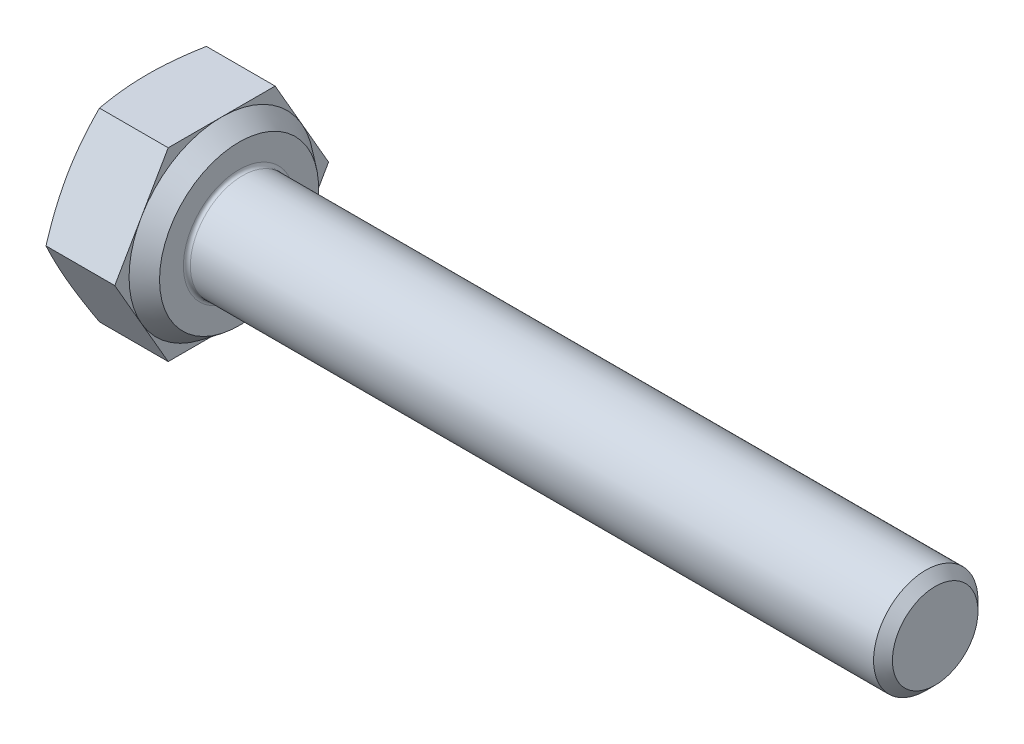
ISO-10303-21;
HEADER;
FILE_DESCRIPTION(('STEP AP214'),'2;1');
FILE_NAME('part.step','',(''),(''),'','','');
FILE_SCHEMA(('AUTOMOTIVE_DESIGN { 1 0 10303 214 1 1 1 1 }'));
ENDSEC;
DATA;
#1=APPLICATION_CONTEXT('core data for automotive mechanical design processes');
#2=APPLICATION_PROTOCOL_DEFINITION('international standard','automotive_design',2000,#1);
#3=PRODUCT_CONTEXT('',#1,'mechanical');
#4=PRODUCT('Part','Part','',(#3));
#5=PRODUCT_RELATED_PRODUCT_CATEGORY('part','',(#4));
#6=PRODUCT_DEFINITION_FORMATION('','',#4);
#7=PRODUCT_DEFINITION_CONTEXT('part definition',#1,'design');
#8=PRODUCT_DEFINITION('design','',#6,#7);
#9=PRODUCT_DEFINITION_SHAPE('','',#8);
#10=(LENGTH_UNIT() NAMED_UNIT(*) SI_UNIT(.MILLI.,.METRE.));
#11=(NAMED_UNIT(*) PLANE_ANGLE_UNIT() SI_UNIT($,.RADIAN.));
#12=(NAMED_UNIT(*) SI_UNIT($,.STERADIAN.) SOLID_ANGLE_UNIT());
#13=UNCERTAINTY_MEASURE_WITH_UNIT(LENGTH_MEASURE(1.E-05),#10,'distance_accuracy_value','');
#14=(GEOMETRIC_REPRESENTATION_CONTEXT(3) GLOBAL_UNCERTAINTY_ASSIGNED_CONTEXT((#13)) GLOBAL_UNIT_ASSIGNED_CONTEXT((#10,
#11,#12)) REPRESENTATION_CONTEXT('',''));
#15=CARTESIAN_POINT('',(0.,0.,0.));
#16=DIRECTION('',(0.,0.,1.));
#17=DIRECTION('',(1.,0.,0.));
#18=AXIS2_PLACEMENT_3D('',#15,#16,#17);
#19=CARTESIAN_POINT('',(2.625,0.,0.));
#20=DIRECTION('',(1.,0.,0.));
#21=DIRECTION('',(0.,0.,-1.));
#22=AXIS2_PLACEMENT_3D('',#19,#20,#21);
#23=PLANE('',#22);
#24=CARTESIAN_POINT('',(2.625,0.,0.));
#25=DIRECTION('',(1.,0.,0.));
#26=DIRECTION('',(0.,0.,-1.));
#27=AXIS2_PLACEMENT_3D('',#24,#25,#26);
#28=CIRCLE('',#27,1.6);
#29=CARTESIAN_POINT('',(2.625,0.,-1.6));
#30=VERTEX_POINT('',#29);
#31=EDGE_CURVE('E188',#30,#30,#28,.F.);
#32=ORIENTED_EDGE('',*,*,#31,.T.);
#33=EDGE_LOOP('',(#32));
#34=FACE_BOUND('',#33,.T.);
#35=CARTESIAN_POINT('',(2.625,0.,0.));
#36=DIRECTION('',(-1.,0.,0.));
#37=DIRECTION('',(0.,0.,1.));
#38=AXIS2_PLACEMENT_3D('',#35,#36,#37);
#39=CIRCLE('',#38,2.285);
#40=CARTESIAN_POINT('',(2.625,0.,2.285));
#41=VERTEX_POINT('',#40);
#42=EDGE_CURVE('E139',#41,#41,#39,.T.);
#43=ORIENTED_EDGE('',*,*,#42,.F.);
#44=EDGE_LOOP('',(#43));
#45=FACE_BOUND('',#44,.T.);
#46=ADVANCED_FACE('F33',(#34,#45),#23,.T.);
#47=CARTESIAN_POINT('',(2.125,0.,-3.07150343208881));
#48=DIRECTION('',(1.,0.,0.));
#49=DIRECTION('',(0.,0.,-1.));
#50=AXIS2_PLACEMENT_3D('',#47,#48,#49);
#51=PLANE('',#50);
#52=DIRECTION('',(0.,-0.866025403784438,0.5));
#53=VECTOR('',#52,1.);
#54=CARTESIAN_POINT('',(2.125,2.66,1.53575171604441));
#55=LINE('',#54,#53);
#56=CARTESIAN_POINT('',(2.125,2.66,1.53575171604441));
#57=VERTEX_POINT('',#56);
#58=CARTESIAN_POINT('',(2.125,1.33,2.30362757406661));
#59=VERTEX_POINT('',#58);
#60=EDGE_CURVE('E138',#57,#59,#55,.T.);
#61=ORIENTED_EDGE('',*,*,#60,.T.);
#62=CARTESIAN_POINT('',(2.125,0.,0.));
#63=DIRECTION('',(-1.,0.,0.));
#64=DIRECTION('',(0.,0.,1.));
#65=AXIS2_PLACEMENT_3D('',#62,#63,#64);
#66=CIRCLE('',#65,2.66);
#67=CARTESIAN_POINT('',(2.125,2.66,0.));
#68=VERTEX_POINT('',#67);
#69=EDGE_CURVE('E49',#59,#68,#66,.T.);
#70=ORIENTED_EDGE('',*,*,#69,.T.);
#71=DIRECTION('',(0.,0.,1.));
#72=VECTOR('',#71,1.);
#73=CARTESIAN_POINT('',(2.125,2.66,-1.5357517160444));
#74=LINE('',#73,#72);
#75=EDGE_CURVE('E135',#68,#57,#74,.T.);
#76=ORIENTED_EDGE('',*,*,#75,.T.);
#77=EDGE_LOOP('',(#61,#70,#76));
#78=FACE_BOUND('',#77,.T.);
#79=ADVANCED_FACE('F134',(#78),#51,.T.);
#80=CARTESIAN_POINT('',(2.125,2.66,-1.5357517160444));
#81=VERTEX_POINT('',#80);
#82=EDGE_CURVE('E145',#81,#68,#74,.T.);
#83=ORIENTED_EDGE('',*,*,#82,.T.);
#84=CARTESIAN_POINT('',(2.125,1.33,-2.3036275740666));
#85=VERTEX_POINT('',#84);
#86=EDGE_CURVE('E122',#68,#85,#66,.T.);
#87=ORIENTED_EDGE('',*,*,#86,.T.);
#88=DIRECTION('',(0.,0.866025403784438,0.5));
#89=VECTOR('',#88,1.);
#90=CARTESIAN_POINT('',(2.125,0.,-3.07150343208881));
#91=LINE('',#90,#89);
#92=EDGE_CURVE('E151',#85,#81,#91,.T.);
#93=ORIENTED_EDGE('',*,*,#92,.T.);
#94=EDGE_LOOP('',(#83,#87,#93));
#95=FACE_BOUND('',#94,.T.);
#96=ADVANCED_FACE('F150',(#95),#51,.T.);
#97=CARTESIAN_POINT('',(2.125,0.,-3.07150343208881));
#98=VERTEX_POINT('',#97);
#99=EDGE_CURVE('E148',#98,#85,#91,.T.);
#100=ORIENTED_EDGE('',*,*,#99,.T.);
#101=CARTESIAN_POINT('',(2.125,-1.33,-2.3036275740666));
#102=VERTEX_POINT('',#101);
#103=EDGE_CURVE('E125',#85,#102,#66,.T.);
#104=ORIENTED_EDGE('',*,*,#103,.T.);
#105=DIRECTION('',(0.,0.866025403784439,-0.5));
#106=VECTOR('',#105,1.);
#107=CARTESIAN_POINT('',(2.125,-2.66,-1.53575171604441));
#108=LINE('',#107,#106);
#109=EDGE_CURVE('E306',#102,#98,#108,.T.);
#110=ORIENTED_EDGE('',*,*,#109,.T.);
#111=EDGE_LOOP('',(#100,#104,#110));
#112=FACE_BOUND('',#111,.T.);
#113=ADVANCED_FACE('F337',(#112),#51,.T.);
#114=CARTESIAN_POINT('',(2.125,-2.66,-1.53575171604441));
#115=VERTEX_POINT('',#114);
#116=EDGE_CURVE('E304',#115,#102,#108,.T.);
#117=ORIENTED_EDGE('',*,*,#116,.T.);
#118=CARTESIAN_POINT('',(2.125,-2.66,0.));
#119=VERTEX_POINT('',#118);
#120=EDGE_CURVE('E338',#102,#119,#66,.T.);
#121=ORIENTED_EDGE('',*,*,#120,.T.);
#122=DIRECTION('',(0.,0.,-1.));
#123=VECTOR('',#122,1.);
#124=CARTESIAN_POINT('',(2.125,-2.66,1.53575171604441));
#125=LINE('',#124,#123);
#126=EDGE_CURVE('E162',#119,#115,#125,.T.);
#127=ORIENTED_EDGE('',*,*,#126,.T.);
#128=EDGE_LOOP('',(#117,#121,#127));
#129=FACE_BOUND('',#128,.T.);
#130=ADVANCED_FACE('F352',(#129),#51,.T.);
#131=CARTESIAN_POINT('',(2.125,-2.66,1.53575171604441));
#132=VERTEX_POINT('',#131);
#133=EDGE_CURVE('E163',#132,#119,#125,.T.);
#134=ORIENTED_EDGE('',*,*,#133,.T.);
#135=CARTESIAN_POINT('',(2.125,-1.33,2.30362757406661));
#136=VERTEX_POINT('',#135);
#137=EDGE_CURVE('E339',#119,#136,#66,.T.);
#138=ORIENTED_EDGE('',*,*,#137,.T.);
#139=DIRECTION('',(0.,-0.866025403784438,-0.5));
#140=VECTOR('',#139,1.);
#141=CARTESIAN_POINT('',(2.125,0.,3.07150343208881));
#142=LINE('',#141,#140);
#143=EDGE_CURVE('E158',#136,#132,#142,.T.);
#144=ORIENTED_EDGE('',*,*,#143,.T.);
#145=EDGE_LOOP('',(#134,#138,#144));
#146=FACE_BOUND('',#145,.T.);
#147=ADVANCED_FACE('F347',(#146),#51,.T.);
#148=CARTESIAN_POINT('',(2.125,0.,3.07150343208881));
#149=VERTEX_POINT('',#148);
#150=EDGE_CURVE('E159',#149,#136,#142,.T.);
#151=ORIENTED_EDGE('',*,*,#150,.T.);
#152=EDGE_CURVE('E140',#136,#59,#66,.T.);
#153=ORIENTED_EDGE('',*,*,#152,.T.);
#154=EDGE_CURVE('E153',#59,#149,#55,.T.);
#155=ORIENTED_EDGE('',*,*,#154,.T.);
#156=EDGE_LOOP('',(#151,#153,#155));
#157=FACE_BOUND('',#156,.T.);
#158=ADVANCED_FACE('F213',(#157),#51,.T.);
#159=CARTESIAN_POINT('',(2.125,-2.66,-1.53575171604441));
#160=DIRECTION('',(0.,0.5,0.866025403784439));
#161=DIRECTION('',(0.,-0.866025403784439,0.5));
#162=AXIS2_PLACEMENT_3D('',#159,#160,#161);
#163=PLANE('',#162);
#164=CARTESIAN_POINT('',(0.149817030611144,0.000199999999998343,-3.07161890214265));
#165=CARTESIAN_POINT('',(0.1266552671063,-0.109972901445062,-3.00801054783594));
#166=CARTESIAN_POINT('',(0.10558551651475,-0.220509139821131,-2.94419242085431));
#167=CARTESIAN_POINT('',(0.0685164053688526,-0.44230043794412,-2.81614115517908));
#168=CARTESIAN_POINT('',(0.0525210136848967,-0.553555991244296,-2.75190773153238));
#169=CARTESIAN_POINT('',(0.0266488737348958,-0.775551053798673,-2.62373882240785));
#170=CARTESIAN_POINT('',(0.016715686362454,-0.886285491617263,-2.55980626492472));
#171=CARTESIAN_POINT('',(0.00339247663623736,-1.10801336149,-2.43179161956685));
#172=CARTESIAN_POINT('',(0.,-1.219006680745,-2.36770959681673));
#173=CARTESIAN_POINT('',(0.,-1.440993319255,-2.23954555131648));
#174=CARTESIAN_POINT('',(0.0033924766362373,-1.55198663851,-2.17546352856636));
#175=CARTESIAN_POINT('',(0.0167156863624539,-1.77371450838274,-2.04744888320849));
#176=CARTESIAN_POINT('',(0.0266488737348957,-1.88444894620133,-1.98351632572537));
#177=CARTESIAN_POINT('',(0.0525210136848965,-2.1064440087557,-1.85534741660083));
#178=CARTESIAN_POINT('',(0.0685164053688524,-2.21769956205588,-1.79111399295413));
#179=CARTESIAN_POINT('',(0.10558551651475,-2.43949086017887,-1.66306272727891));
#180=CARTESIAN_POINT('',(0.1266552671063,-2.55002709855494,-1.59924460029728));
#181=CARTESIAN_POINT('',(0.149817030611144,-2.6602,-1.53563624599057));
#182=B_SPLINE_CURVE_WITH_KNOTS('',3,(#164,#165,#166,#167,#168,#169,#170,#171,#172,#173,#174,
#175,#176,#177,#178,#179,#180,#181),.UNSPECIFIED.,.F.,.F.,(4,2,2,2,2,2,2,2,4),(0.,
0.387964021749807,0.77623074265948,1.16082524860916,1.54527541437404,1.92972558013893,
2.31432008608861,2.70258680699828,3.09055082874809),.UNSPECIFIED.);
#183=CARTESIAN_POINT('',(0.149775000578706,0.,-3.07150343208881));
#184=VERTEX_POINT('',#183);
#185=CARTESIAN_POINT('',(0.,-1.33,-2.30362757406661));
#186=VERTEX_POINT('',#185);
#187=EDGE_CURVE('E321',#184,#186,#182,.T.);
#188=ORIENTED_EDGE('',*,*,#187,.F.);
#189=DIRECTION('',(-1.,0.,0.));
#190=VECTOR('',#189,1.);
#191=CARTESIAN_POINT('',(2.125,0.,-3.07150343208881));
#192=LINE('',#191,#190);
#193=EDGE_CURVE('E178',#98,#184,#192,.T.);
#194=ORIENTED_EDGE('',*,*,#193,.F.);
#195=ORIENTED_EDGE('',*,*,#109,.F.);
#196=ORIENTED_EDGE('',*,*,#116,.F.);
#197=DIRECTION('',(-1.,0.,0.));
#198=VECTOR('',#197,1.);
#199=CARTESIAN_POINT('',(2.125,-2.66,-1.53575171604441));
#200=LINE('',#199,#198);
#201=CARTESIAN_POINT('',(0.149775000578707,-2.66,-1.53575171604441));
#202=VERTEX_POINT('',#201);
#203=EDGE_CURVE('E166',#115,#202,#200,.T.);
#204=ORIENTED_EDGE('',*,*,#203,.T.);
#205=EDGE_CURVE('E246',#186,#202,#182,.T.);
#206=ORIENTED_EDGE('',*,*,#205,.F.);
#207=EDGE_LOOP('',(#188,#194,#195,#196,#204,#206));
#208=FACE_BOUND('',#207,.T.);
#209=ADVANCED_FACE('F35',(#208),#163,.F.);
#210=CARTESIAN_POINT('',(2.125,0.,-3.07150343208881));
#211=DIRECTION('',(0.,-0.500000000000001,0.866025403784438));
#212=DIRECTION('',(0.,-0.866025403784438,-0.500000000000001));
#213=AXIS2_PLACEMENT_3D('',#210,#211,#212);
#214=PLANE('',#213);
#215=CARTESIAN_POINT('',(0.149817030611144,2.6602,-1.53563624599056));
#216=CARTESIAN_POINT('',(0.1266552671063,2.55002709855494,-1.59924460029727));
#217=CARTESIAN_POINT('',(0.10558551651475,2.43949086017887,-1.6630627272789));
#218=CARTESIAN_POINT('',(0.0685164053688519,2.21769956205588,-1.79111399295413));
#219=CARTESIAN_POINT('',(0.052521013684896,2.10644400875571,-1.85534741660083));
#220=CARTESIAN_POINT('',(0.0266488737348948,1.88444894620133,-1.98351632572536));
#221=CARTESIAN_POINT('',(0.0167156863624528,1.77371450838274,-2.04744888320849));
#222=CARTESIAN_POINT('',(0.00339247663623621,1.55198663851,-2.17546352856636));
#223=CARTESIAN_POINT('',(0.,1.440993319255,-2.23954555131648));
#224=CARTESIAN_POINT('',(0.,1.219006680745,-2.36770959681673));
#225=CARTESIAN_POINT('',(0.00339247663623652,1.10801336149,-2.43179161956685));
#226=CARTESIAN_POINT('',(0.0167156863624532,0.886285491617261,-2.55980626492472));
#227=CARTESIAN_POINT('',(0.0266488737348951,0.775551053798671,-2.62373882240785));
#228=CARTESIAN_POINT('',(0.0525210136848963,0.553555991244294,-2.75190773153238));
#229=CARTESIAN_POINT('',(0.0685164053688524,0.442300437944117,-2.81614115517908));
#230=CARTESIAN_POINT('',(0.10558551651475,0.220509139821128,-2.94419242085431));
#231=CARTESIAN_POINT('',(0.1266552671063,0.109972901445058,-3.00801054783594));
#232=CARTESIAN_POINT('',(0.149817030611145,-0.000200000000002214,-3.07161890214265));
#233=B_SPLINE_CURVE_WITH_KNOTS('',3,(#215,#216,#217,#218,#219,#220,#221,#222,#223,#224,#225,
#226,#227,#228,#229,#230,#231,#232),.UNSPECIFIED.,.F.,.F.,(4,2,2,2,2,2,2,2,4),(0.,
0.387964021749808,0.776230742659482,1.16082524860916,1.54527541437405,1.92972558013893,
2.31432008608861,2.70258680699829,3.09055082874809),.UNSPECIFIED.);
#234=CARTESIAN_POINT('',(0.149775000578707,2.66,-1.5357517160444));
#235=VERTEX_POINT('',#234);
#236=CARTESIAN_POINT('',(0.,1.33,-2.30362757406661));
#237=VERTEX_POINT('',#236);
#238=EDGE_CURVE('E261',#235,#237,#233,.T.);
#239=ORIENTED_EDGE('',*,*,#238,.F.);
#240=DIRECTION('',(-1.,0.,0.));
#241=VECTOR('',#240,1.);
#242=CARTESIAN_POINT('',(2.125,2.66,-1.5357517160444));
#243=LINE('',#242,#241);
#244=EDGE_CURVE('E176',#81,#235,#243,.T.);
#245=ORIENTED_EDGE('',*,*,#244,.F.);
#246=ORIENTED_EDGE('',*,*,#92,.F.);
#247=ORIENTED_EDGE('',*,*,#99,.F.);
#248=ORIENTED_EDGE('',*,*,#193,.T.);
#249=EDGE_CURVE('E257',#237,#184,#233,.T.);
#250=ORIENTED_EDGE('',*,*,#249,.F.);
#251=EDGE_LOOP('',(#239,#245,#246,#247,#248,#250));
#252=FACE_BOUND('',#251,.T.);
#253=ADVANCED_FACE('F267',(#252),#214,.F.);
#254=CARTESIAN_POINT('',(2.125,2.66,-1.5357517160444));
#255=DIRECTION('',(0.,-1.,0.));
#256=DIRECTION('',(0.,0.,-1.));
#257=AXIS2_PLACEMENT_3D('',#254,#255,#256);
#258=PLANE('',#257);
#259=CARTESIAN_POINT('',(0.800338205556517,2.66,-4.06613053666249));
#260=CARTESIAN_POINT('',(0.763692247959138,2.66,-3.94578245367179));
#261=CARTESIAN_POINT('',(0.727473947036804,2.66,-3.8253018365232));
#262=CARTESIAN_POINT('',(0.656129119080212,2.66,-3.58400782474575));
#263=CARTESIAN_POINT('',(0.621002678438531,2.66,-3.46319440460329));
#264=CARTESIAN_POINT('',(0.552019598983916,2.66,-3.22096029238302));
#265=CARTESIAN_POINT('',(0.518165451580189,2.66,-3.09953888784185));
#266=CARTESIAN_POINT('',(0.452123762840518,2.66,-2.8562451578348));
#267=CARTESIAN_POINT('',(0.419936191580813,2.66,-2.7343728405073));
#268=CARTESIAN_POINT('',(0.358023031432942,2.66,-2.49160023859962));
#269=CARTESIAN_POINT('',(0.32827195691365,2.66,-2.37070652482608));
#270=CARTESIAN_POINT('',(0.271306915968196,2.66,-2.1283243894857));
#271=CARTESIAN_POINT('',(0.24409306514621,2.66,-2.00683594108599));
#272=CARTESIAN_POINT('',(0.167186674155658,2.66,-1.64142901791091));
#273=CARTESIAN_POINT('',(0.122197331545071,2.66,-1.39644838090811));
#274=CARTESIAN_POINT('',(0.0708271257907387,2.66,-1.04074258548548));
#275=CARTESIAN_POINT('',(0.0568876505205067,2.66,-0.931102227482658));
#276=CARTESIAN_POINT('',(0.0332945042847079,2.66,-0.711365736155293));
#277=CARTESIAN_POINT('',(0.023640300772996,2.66,-0.601269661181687));
#278=CARTESIAN_POINT('',(0.00907749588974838,2.66,-0.380832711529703));
#279=CARTESIAN_POINT('',(0.00416576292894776,2.66,-0.270492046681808));
#280=CARTESIAN_POINT('',(-0.00066185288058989,2.66,-0.0497001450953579));
#281=CARTESIAN_POINT('',(-0.000577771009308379,2.66,0.060751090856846));
#282=CARTESIAN_POINT('',(0.00459443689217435,2.66,0.282092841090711));
#283=CARTESIAN_POINT('',(0.00970784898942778,2.66,0.392982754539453));
#284=CARTESIAN_POINT('',(0.0247038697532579,2.66,0.614440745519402));
#285=CARTESIAN_POINT('',(0.0345867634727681,2.66,0.725008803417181));
#286=CARTESIAN_POINT('',(0.0586582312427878,2.66,0.945763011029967));
#287=CARTESIAN_POINT('',(0.072850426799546,2.66,1.05594876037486));
#288=CARTESIAN_POINT('',(0.104968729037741,2.66,1.27576754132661));
#289=CARTESIAN_POINT('',(0.122894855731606,2.66,1.38540056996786));
#290=CARTESIAN_POINT('',(0.183438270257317,2.66,1.7250182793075));
#291=CARTESIAN_POINT('',(0.231440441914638,2.66,1.95404028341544));
#292=CARTESIAN_POINT('',(0.336683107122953,2.66,2.40995741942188));
#293=CARTESIAN_POINT('',(0.393926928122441,2.66,2.63685175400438));
#294=CARTESIAN_POINT('',(0.514573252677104,2.66,3.08929571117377));
#295=CARTESIAN_POINT('',(0.577983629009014,2.66,3.31484321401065));
#296=CARTESIAN_POINT('',(0.708883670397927,2.66,3.76470051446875));
#297=CARTESIAN_POINT('',(0.776372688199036,2.66,3.98901050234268));
#298=CARTESIAN_POINT('',(0.913412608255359,2.66,4.43428675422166));
#299=CARTESIAN_POINT('',(0.982932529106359,2.66,4.65526259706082));
#300=CARTESIAN_POINT('',(1.12394706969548,2.66,5.09659289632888));
#301=CARTESIAN_POINT('',(1.19544178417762,2.66,5.31694732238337));
#302=CARTESIAN_POINT('',(1.33959659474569,2.66,5.75634755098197));
#303=CARTESIAN_POINT('',(1.41225123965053,2.66,5.97539514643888));
#304=CARTESIAN_POINT('',(1.55864986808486,2.66,6.41310625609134));
#305=CARTESIAN_POINT('',(1.63239376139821,2.66,6.63176980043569));
#306=CARTESIAN_POINT('',(1.70651873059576,2.66,6.85030222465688));
#307=B_SPLINE_CURVE_WITH_KNOTS('',3,(#259,#260,#261,#262,#263,#264,#265,#266,#267,#268,#269,
#270,#271,#272,#273,#274,#275,#276,#277,#278,#279,#280,#281,#282,#283,#284,#285,#286,#287,#288,
#289,#290,#291,#292,#293,#294,#295,#296,#297,#298,#299,#300,#301,#302,#303,#304,#305,#306),
.UNSPECIFIED.,.F.,.F.,(4,2,2,2,2,2,2,2,2,2,2,2,2,2,2,2,2,2,2,2,2,2,2,4),(0.,0.377413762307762,
0.754857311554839,1.13300507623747,1.51114604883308,1.88461936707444,2.25810969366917,
3.004716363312,3.3362177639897,3.66767795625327,3.99891912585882,4.3301579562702,4.663070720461,
4.99600338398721,5.32921661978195,5.66243164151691,6.36408571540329,7.06599298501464,
7.7688084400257,8.47151265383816,9.16646049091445,9.86144172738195,10.5537859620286,
11.2460731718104),.UNSPECIFIED.);
#308=CARTESIAN_POINT('',(0.149775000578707,2.66,1.53575171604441));
#309=VERTEX_POINT('',#308);
#310=CARTESIAN_POINT('',(0.,2.66,0.));
#311=VERTEX_POINT('',#310);
#312=EDGE_CURVE('E57',#309,#311,#307,.F.);
#313=ORIENTED_EDGE('',*,*,#312,.F.);
#314=DIRECTION('',(-1.,0.,0.));
#315=VECTOR('',#314,1.);
#316=CARTESIAN_POINT('',(2.125,2.66,1.53575171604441));
#317=LINE('',#316,#315);
#318=EDGE_CURVE('E147',#57,#309,#317,.T.);
#319=ORIENTED_EDGE('',*,*,#318,.F.);
#320=ORIENTED_EDGE('',*,*,#75,.F.);
#321=ORIENTED_EDGE('',*,*,#82,.F.);
#322=ORIENTED_EDGE('',*,*,#244,.T.);
#323=EDGE_CURVE('E262',#311,#235,#307,.F.);
#324=ORIENTED_EDGE('',*,*,#323,.F.);
#325=EDGE_LOOP('',(#313,#319,#320,#321,#322,#324));
#326=FACE_BOUND('',#325,.T.);
#327=ADVANCED_FACE('F143',(#326),#258,.F.);
#328=CARTESIAN_POINT('',(2.125,2.66,1.53575171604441));
#329=DIRECTION('',(0.,-0.5,-0.866025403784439));
#330=DIRECTION('',(0.,0.866025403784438,-0.5));
#331=AXIS2_PLACEMENT_3D('',#328,#329,#330);
#332=PLANE('',#331);
#333=CARTESIAN_POINT('',(0.149817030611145,-0.000199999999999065,3.07161890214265));
#334=CARTESIAN_POINT('',(0.126655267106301,0.109972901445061,3.00801054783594));
#335=CARTESIAN_POINT('',(0.105585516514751,0.22050913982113,2.94419242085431));
#336=CARTESIAN_POINT('',(0.0685164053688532,0.44230043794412,2.81614115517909));
#337=CARTESIAN_POINT('',(0.0525210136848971,0.553555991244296,2.75190773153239));
#338=CARTESIAN_POINT('',(0.0266488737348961,0.775551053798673,2.62373882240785));
#339=CARTESIAN_POINT('',(0.0167156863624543,0.886285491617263,2.55980626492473));
#340=CARTESIAN_POINT('',(0.00339247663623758,1.10801336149,2.43179161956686));
#341=CARTESIAN_POINT('',(0.,1.219006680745,2.36770959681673));
#342=CARTESIAN_POINT('',(0.,1.440993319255,2.23954555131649));
#343=CARTESIAN_POINT('',(0.0033924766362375,1.55198663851,2.17546352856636));
#344=CARTESIAN_POINT('',(0.0167156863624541,1.77371450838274,2.04744888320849));
#345=CARTESIAN_POINT('',(0.0266488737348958,1.88444894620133,1.98351632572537));
#346=CARTESIAN_POINT('',(0.0525210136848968,2.10644400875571,1.85534741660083));
#347=CARTESIAN_POINT('',(0.0685164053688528,2.21769956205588,1.79111399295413));
#348=CARTESIAN_POINT('',(0.105585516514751,2.43949086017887,1.66306272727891));
#349=CARTESIAN_POINT('',(0.126655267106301,2.55002709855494,1.59924460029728));
#350=CARTESIAN_POINT('',(0.149817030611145,2.6602,1.53563624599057));
#351=B_SPLINE_CURVE_WITH_KNOTS('',3,(#333,#334,#335,#336,#337,#338,#339,#340,#341,#342,#343,
#344,#345,#346,#347,#348,#349,#350),.UNSPECIFIED.,.F.,.F.,(4,2,2,2,2,2,2,2,4),(0.,
0.387964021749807,0.776230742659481,1.16082524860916,1.54527541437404,1.92972558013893,
2.31432008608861,2.70258680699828,3.09055082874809),.UNSPECIFIED.);
#352=CARTESIAN_POINT('',(0.149775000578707,0.,3.07150343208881));
#353=VERTEX_POINT('',#352);
#354=CARTESIAN_POINT('',(0.,1.33,2.30362757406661));
#355=VERTEX_POINT('',#354);
#356=EDGE_CURVE('E251',#353,#355,#351,.T.);
#357=ORIENTED_EDGE('',*,*,#356,.F.);
#358=DIRECTION('',(-1.,0.,0.));
#359=VECTOR('',#358,1.);
#360=CARTESIAN_POINT('',(2.125,0.,3.07150343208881));
#361=LINE('',#360,#359);
#362=EDGE_CURVE('E172',#149,#353,#361,.T.);
#363=ORIENTED_EDGE('',*,*,#362,.F.);
#364=ORIENTED_EDGE('',*,*,#154,.F.);
#365=ORIENTED_EDGE('',*,*,#60,.F.);
#366=ORIENTED_EDGE('',*,*,#318,.T.);
#367=EDGE_CURVE('E312',#355,#309,#351,.T.);
#368=ORIENTED_EDGE('',*,*,#367,.F.);
#369=EDGE_LOOP('',(#357,#363,#364,#365,#366,#368));
#370=FACE_BOUND('',#369,.T.);
#371=ADVANCED_FACE('F273',(#370),#332,.F.);
#372=CARTESIAN_POINT('',(2.125,0.,3.07150343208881));
#373=DIRECTION('',(0.,0.5,-0.866025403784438));
#374=DIRECTION('',(0.,0.866025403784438,0.5));
#375=AXIS2_PLACEMENT_3D('',#372,#373,#374);
#376=PLANE('',#375);
#377=CARTESIAN_POINT('',(0.149817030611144,-2.6602,1.53563624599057));
#378=CARTESIAN_POINT('',(0.1266552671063,-2.55002709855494,1.59924460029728));
#379=CARTESIAN_POINT('',(0.10558551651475,-2.43949086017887,1.66306272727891));
#380=CARTESIAN_POINT('',(0.0685164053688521,-2.21769956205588,1.79111399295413));
#381=CARTESIAN_POINT('',(0.0525210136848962,-2.1064440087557,1.85534741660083));
#382=CARTESIAN_POINT('',(0.0266488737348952,-1.88444894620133,1.98351632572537));
#383=CARTESIAN_POINT('',(0.0167156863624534,-1.77371450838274,2.04744888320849));
#384=CARTESIAN_POINT('',(0.00339247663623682,-1.55198663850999,2.17546352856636));
#385=CARTESIAN_POINT('',(0.,-1.440993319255,2.23954555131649));
#386=CARTESIAN_POINT('',(0.,-1.219006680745,2.36770959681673));
#387=CARTESIAN_POINT('',(0.0033924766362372,-1.10801336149,2.43179161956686));
#388=CARTESIAN_POINT('',(0.0167156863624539,-0.886285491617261,2.55980626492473));
#389=CARTESIAN_POINT('',(0.0266488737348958,-0.775551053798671,2.62373882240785));
#390=CARTESIAN_POINT('',(0.0525210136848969,-0.553555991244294,2.75190773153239));
#391=CARTESIAN_POINT('',(0.068516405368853,-0.442300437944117,2.81614115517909));
#392=CARTESIAN_POINT('',(0.105585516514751,-0.220509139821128,2.94419242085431));
#393=CARTESIAN_POINT('',(0.126655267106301,-0.109972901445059,3.00801054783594));
#394=CARTESIAN_POINT('',(0.149817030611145,0.000200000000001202,3.07161890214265));
#395=B_SPLINE_CURVE_WITH_KNOTS('',3,(#377,#378,#379,#380,#381,#382,#383,#384,#385,#386,#387,
#388,#389,#390,#391,#392,#393,#394),.UNSPECIFIED.,.F.,.F.,(4,2,2,2,2,2,2,2,4),(0.,
0.387964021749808,0.776230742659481,1.16082524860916,1.54527541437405,1.92972558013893,
2.31432008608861,2.70258680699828,3.09055082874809),.UNSPECIFIED.);
#396=CARTESIAN_POINT('',(0.149775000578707,-2.66,1.53575171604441));
#397=VERTEX_POINT('',#396);
#398=CARTESIAN_POINT('',(0.,-1.33,2.30362757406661));
#399=VERTEX_POINT('',#398);
#400=EDGE_CURVE('E239',#397,#399,#395,.T.);
#401=ORIENTED_EDGE('',*,*,#400,.F.);
#402=DIRECTION('',(-1.,0.,0.));
#403=VECTOR('',#402,1.);
#404=CARTESIAN_POINT('',(2.125,-2.66,1.53575171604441));
#405=LINE('',#404,#403);
#406=EDGE_CURVE('E169',#132,#397,#405,.T.);
#407=ORIENTED_EDGE('',*,*,#406,.F.);
#408=ORIENTED_EDGE('',*,*,#143,.F.);
#409=ORIENTED_EDGE('',*,*,#150,.F.);
#410=ORIENTED_EDGE('',*,*,#362,.T.);
#411=EDGE_CURVE('E317',#399,#353,#395,.T.);
#412=ORIENTED_EDGE('',*,*,#411,.F.);
#413=EDGE_LOOP('',(#401,#407,#408,#409,#410,#412));
#414=FACE_BOUND('',#413,.T.);
#415=ADVANCED_FACE('F276',(#414),#376,.F.);
#416=CARTESIAN_POINT('',(2.125,-2.66,1.53575171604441));
#417=DIRECTION('',(0.,1.,0.));
#418=DIRECTION('',(0.,0.,1.));
#419=AXIS2_PLACEMENT_3D('',#416,#417,#418);
#420=PLANE('',#419);
#421=CARTESIAN_POINT('',(0.800338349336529,-2.66,-4.06613100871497));
#422=CARTESIAN_POINT('',(0.763692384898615,-2.66,-3.94578290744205));
#423=CARTESIAN_POINT('',(0.727474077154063,-2.66,-3.8253022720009));
#424=CARTESIAN_POINT('',(0.656129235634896,-2.66,-3.58400822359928));
#425=CARTESIAN_POINT('',(0.621002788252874,-2.66,-3.46319478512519));
#426=CARTESIAN_POINT('',(0.552019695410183,-2.66,-3.22096063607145));
#427=CARTESIAN_POINT('',(0.51816554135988,-2.66,-3.09953921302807));
#428=CARTESIAN_POINT('',(0.452123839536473,-2.66,-2.85624544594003));
#429=CARTESIAN_POINT('',(0.419936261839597,-2.66,-2.73437311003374));
#430=CARTESIAN_POINT('',(0.358023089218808,-2.66,-2.4916004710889));
#431=CARTESIAN_POINT('',(0.328272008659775,-2.66,-2.37070673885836));
#432=CARTESIAN_POINT('',(0.271306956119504,-2.66,-2.12832456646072));
#433=CARTESIAN_POINT('',(0.244093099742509,-2.66,-2.00683609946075));
#434=CARTESIAN_POINT('',(0.167186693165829,-2.66,-1.6414291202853));
#435=CARTESIAN_POINT('',(0.122197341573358,-2.66,-1.39644844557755));
#436=CARTESIAN_POINT('',(0.0708271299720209,-2.66,-1.0407426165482));
#437=CARTESIAN_POINT('',(0.0568876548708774,-2.66,-0.93110226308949));
#438=CARTESIAN_POINT('',(0.0332945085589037,-2.66,-0.711365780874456));
#439=CARTESIAN_POINT('',(0.0236403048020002,-2.66,-0.601269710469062));
#440=CARTESIAN_POINT('',(0.00907749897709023,-2.66,-0.380832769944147));
#441=CARTESIAN_POINT('',(0.00416576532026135,-2.66,-0.270492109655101));
#442=CARTESIAN_POINT('',(-0.000661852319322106,-2.66,-0.0497002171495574));
#443=CARTESIAN_POINT('',(-0.000577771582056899,-2.66,0.0607510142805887));
#444=CARTESIAN_POINT('',(0.00459443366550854,-2.66,0.282092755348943));
#445=CARTESIAN_POINT('',(0.00970784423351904,-2.66,0.392982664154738));
#446=CARTESIAN_POINT('',(0.0247038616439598,-2.66,0.614440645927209));
#447=CARTESIAN_POINT('',(0.0345867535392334,-2.66,0.725008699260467));
#448=CARTESIAN_POINT('',(0.0586582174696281,-2.66,0.945762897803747));
#449=CARTESIAN_POINT('',(0.072850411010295,-2.66,1.05594864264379));
#450=CARTESIAN_POINT('',(0.104968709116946,-2.66,1.27576741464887));
#451=CARTESIAN_POINT('',(0.122894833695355,-2.66,1.38540043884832));
#452=CARTESIAN_POINT('',(0.183438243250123,-2.66,1.72501814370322));
#453=CARTESIAN_POINT('',(0.231440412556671,-2.66,1.95404014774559));
#454=CARTESIAN_POINT('',(0.336683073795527,-2.66,2.40995728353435));
#455=CARTESIAN_POINT('',(0.393926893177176,-2.66,2.63685161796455));
#456=CARTESIAN_POINT('',(0.514573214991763,-2.66,3.08929557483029));
#457=CARTESIAN_POINT('',(0.577983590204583,-2.66,3.31484307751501));
#458=CARTESIAN_POINT('',(0.708883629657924,-2.66,3.76470037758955));
#459=CARTESIAN_POINT('',(0.776372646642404,-2.66,3.98901036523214));
#460=CARTESIAN_POINT('',(0.913412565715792,-2.66,4.43428661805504));
#461=CARTESIAN_POINT('',(0.982932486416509,-2.66,4.65526246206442));
#462=CARTESIAN_POINT('',(1.12394702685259,-2.66,5.09659276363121));
#463=CARTESIAN_POINT('',(1.195441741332,-2.66,5.3169471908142));
#464=CARTESIAN_POINT('',(1.33959655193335,-2.66,5.75634742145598));
#465=CARTESIAN_POINT('',(1.41225119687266,-2.66,5.97539501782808));
#466=CARTESIAN_POINT('',(1.55864982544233,-2.66,6.41310612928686));
#467=CARTESIAN_POINT('',(1.63239371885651,-2.66,6.63176967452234));
#468=CARTESIAN_POINT('',(1.70651868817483,-2.66,6.85030209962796));
#469=B_SPLINE_CURVE_WITH_KNOTS('',3,(#421,#422,#423,#424,#425,#426,#427,#428,#429,#430,#431,
#432,#433,#434,#435,#436,#437,#438,#439,#440,#441,#442,#443,#444,#445,#446,#447,#448,#449,#450,
#451,#452,#453,#454,#455,#456,#457,#458,#459,#460,#461,#462,#463,#464,#465,#466,#467,#468),
.UNSPECIFIED.,.F.,.F.,(4,2,2,2,2,2,2,2,2,2,2,2,2,2,2,2,2,2,2,2,2,2,2,4),(0.,0.377413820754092,
0.754857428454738,1.13300525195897,1.51114628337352,1.88461965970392,2.2581100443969,
3.00471682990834,3.33621821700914,3.66767839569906,3.99891955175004,4.33015836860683,
4.66307111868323,4.99600376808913,5.32921698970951,5.66243199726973,6.36408606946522,
7.06599333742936,7.76880879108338,8.47151300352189,9.16646084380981,9.86144208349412,
10.5537863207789,11.2460735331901),.UNSPECIFIED.);
#470=CARTESIAN_POINT('',(0.,-2.66,0.));
#471=VERTEX_POINT('',#470);
#472=EDGE_CURVE('E295',#202,#471,#469,.T.);
#473=ORIENTED_EDGE('',*,*,#472,.F.);
#474=ORIENTED_EDGE('',*,*,#203,.F.);
#475=ORIENTED_EDGE('',*,*,#126,.F.);
#476=ORIENTED_EDGE('',*,*,#133,.F.);
#477=ORIENTED_EDGE('',*,*,#406,.T.);
#478=EDGE_CURVE('E229',#471,#397,#469,.T.);
#479=ORIENTED_EDGE('',*,*,#478,.F.);
#480=EDGE_LOOP('',(#473,#474,#475,#476,#477,#479));
#481=FACE_BOUND('',#480,.T.);
#482=ADVANCED_FACE('F280',(#481),#420,.F.);
#483=CARTESIAN_POINT('',(0.,0.,0.));
#484=DIRECTION('',(1.,0.,0.));
#485=DIRECTION('',(0.,0.,-1.));
#486=AXIS2_PLACEMENT_3D('',#483,#484,#485);
#487=CONICAL_SURFACE('',#486,2.66,1.22173047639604);
#488=ORIENTED_EDGE('',*,*,#249,.T.);
#489=ORIENTED_EDGE('',*,*,#187,.T.);
#490=CARTESIAN_POINT('',(0.,0.,0.));
#491=DIRECTION('',(1.,0.,0.));
#492=DIRECTION('',(0.,0.,-1.));
#493=AXIS2_PLACEMENT_3D('',#490,#491,#492);
#494=CIRCLE('',#493,2.66);
#495=EDGE_CURVE('E181',#186,#237,#494,.T.);
#496=ORIENTED_EDGE('',*,*,#495,.T.);
#497=EDGE_LOOP('',(#488,#489,#496));
#498=FACE_BOUND('',#497,.T.);
#499=ADVANCED_FACE('F284',(#498),#487,.T.);
#500=ORIENTED_EDGE('',*,*,#205,.T.);
#501=ORIENTED_EDGE('',*,*,#472,.T.);
#502=EDGE_CURVE('E184',#471,#186,#494,.T.);
#503=ORIENTED_EDGE('',*,*,#502,.T.);
#504=EDGE_LOOP('',(#500,#501,#503));
#505=FACE_BOUND('',#504,.T.);
#506=ADVANCED_FACE('F289',(#505),#487,.T.);
#507=ORIENTED_EDGE('',*,*,#400,.T.);
#508=EDGE_CURVE('E330',#399,#471,#494,.T.);
#509=ORIENTED_EDGE('',*,*,#508,.T.);
#510=ORIENTED_EDGE('',*,*,#478,.T.);
#511=EDGE_LOOP('',(#507,#509,#510));
#512=FACE_BOUND('',#511,.T.);
#513=ADVANCED_FACE('F224',(#512),#487,.T.);
#514=ORIENTED_EDGE('',*,*,#356,.T.);
#515=EDGE_CURVE('E336',#355,#399,#494,.T.);
#516=ORIENTED_EDGE('',*,*,#515,.T.);
#517=ORIENTED_EDGE('',*,*,#411,.T.);
#518=EDGE_LOOP('',(#514,#516,#517));
#519=FACE_BOUND('',#518,.T.);
#520=ADVANCED_FACE('F223',(#519),#487,.T.);
#521=ORIENTED_EDGE('',*,*,#312,.T.);
#522=CARTESIAN_POINT('',(0.,0.,0.));
#523=DIRECTION('',(-1.,0.,0.));
#524=DIRECTION('',(0.,0.,1.));
#525=AXIS2_PLACEMENT_3D('',#522,#523,#524);
#526=CIRCLE('',#525,2.66);
#527=EDGE_CURVE('E335',#355,#311,#526,.T.);
#528=ORIENTED_EDGE('',*,*,#527,.F.);
#529=ORIENTED_EDGE('',*,*,#367,.T.);
#530=EDGE_LOOP('',(#521,#528,#529));
#531=FACE_BOUND('',#530,.T.);
#532=ADVANCED_FACE('F218',(#531),#487,.T.);
#533=ORIENTED_EDGE('',*,*,#323,.T.);
#534=ORIENTED_EDGE('',*,*,#238,.T.);
#535=EDGE_CURVE('E185',#237,#311,#494,.T.);
#536=ORIENTED_EDGE('',*,*,#535,.T.);
#537=EDGE_LOOP('',(#533,#534,#536));
#538=FACE_BOUND('',#537,.T.);
#539=ADVANCED_FACE('F222',(#538),#487,.T.);
#540=CARTESIAN_POINT('',(0.,0.,-3.07150343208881));
#541=DIRECTION('',(1.,0.,0.));
#542=DIRECTION('',(0.,0.,-1.));
#543=AXIS2_PLACEMENT_3D('',#540,#541,#542);
#544=PLANE('',#543);
#545=ORIENTED_EDGE('',*,*,#535,.F.);
#546=ORIENTED_EDGE('',*,*,#495,.F.);
#547=ORIENTED_EDGE('',*,*,#502,.F.);
#548=ORIENTED_EDGE('',*,*,#508,.F.);
#549=ORIENTED_EDGE('',*,*,#515,.F.);
#550=ORIENTED_EDGE('',*,*,#527,.T.);
#551=EDGE_LOOP('',(#545,#546,#547,#548,#549,#550));
#552=FACE_BOUND('',#551,.T.);
#553=ADVANCED_FACE('F225',(#552),#544,.F.);
#554=CARTESIAN_POINT('',(2.125,0.,0.));
#555=DIRECTION('',(-1.,0.,0.));
#556=DIRECTION('',(0.,0.,1.));
#557=AXIS2_PLACEMENT_3D('',#554,#555,#556);
#558=CONICAL_SURFACE('',#557,2.66,0.643501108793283);
#559=ORIENTED_EDGE('',*,*,#42,.T.);
#560=EDGE_LOOP('',(#559));
#561=FACE_BOUND('',#560,.T.);
#562=ORIENTED_EDGE('',*,*,#69,.F.);
#563=ORIENTED_EDGE('',*,*,#152,.F.);
#564=ORIENTED_EDGE('',*,*,#137,.F.);
#565=ORIENTED_EDGE('',*,*,#120,.F.);
#566=ORIENTED_EDGE('',*,*,#103,.F.);
#567=ORIENTED_EDGE('',*,*,#86,.F.);
#568=EDGE_LOOP('',(#562,#563,#564,#565,#566,#567));
#569=FACE_BOUND('',#568,.T.);
#570=ADVANCED_FACE('F123',(#561,#569),#558,.T.);
#571=CARTESIAN_POINT('',(22.625,0.,0.));
#572=DIRECTION('',(-1.,0.,0.));
#573=DIRECTION('',(0.,0.,1.));
#574=AXIS2_PLACEMENT_3D('',#571,#572,#573);
#575=CYLINDRICAL_SURFACE('',#574,1.5);
#576=CARTESIAN_POINT('',(22.3545,0.,0.));
#577=DIRECTION('',(1.,0.,0.));
#578=DIRECTION('',(0.,0.,-1.));
#579=AXIS2_PLACEMENT_3D('',#576,#577,#578);
#580=CIRCLE('',#579,1.5);
#581=CARTESIAN_POINT('',(22.3545,0.,-1.5));
#582=VERTEX_POINT('',#581);
#583=EDGE_CURVE('E12',#582,#582,#580,.F.);
#584=ORIENTED_EDGE('',*,*,#583,.T.);
#585=EDGE_LOOP('',(#584));
#586=FACE_BOUND('',#585,.T.);
#587=CARTESIAN_POINT('',(2.725,0.,0.));
#588=DIRECTION('',(1.,0.,0.));
#589=DIRECTION('',(0.,0.,-1.));
#590=AXIS2_PLACEMENT_3D('',#587,#588,#589);
#591=CIRCLE('',#590,1.5);
#592=CARTESIAN_POINT('',(2.725,0.,-1.5));
#593=VERTEX_POINT('',#592);
#594=EDGE_CURVE('E129',#593,#593,#591,.T.);
#595=ORIENTED_EDGE('',*,*,#594,.T.);
#596=EDGE_LOOP('',(#595));
#597=FACE_BOUND('',#596,.T.);
#598=ADVANCED_FACE('F454',(#586,#597),#575,.T.);
#599=CARTESIAN_POINT('',(22.625,0.,0.));
#600=DIRECTION('',(1.,0.,0.));
#601=DIRECTION('',(0.,0.,-1.));
#602=AXIS2_PLACEMENT_3D('',#599,#600,#601);
#603=PLANE('',#602);
#604=CARTESIAN_POINT('',(22.625,0.,0.));
#605=DIRECTION('',(1.,0.,0.));
#606=DIRECTION('',(0.,0.,-1.));
#607=AXIS2_PLACEMENT_3D('',#604,#605,#606);
#608=CIRCLE('',#607,1.2295);
#609=CARTESIAN_POINT('',(22.625,0.,-1.2295));
#610=VERTEX_POINT('',#609);
#611=EDGE_CURVE('E42',#610,#610,#608,.T.);
#612=ORIENTED_EDGE('',*,*,#611,.T.);
#613=EDGE_LOOP('',(#612));
#614=FACE_BOUND('',#613,.T.);
#615=ADVANCED_FACE('F193',(#614),#603,.T.);
#616=CARTESIAN_POINT('',(2.725,0.,0.));
#617=DIRECTION('',(1.,0.,0.));
#618=DIRECTION('',(0.,0.,-1.));
#619=AXIS2_PLACEMENT_3D('',#616,#617,#618);
#620=TOROIDAL_SURFACE('',#619,1.6,0.1);
#621=ORIENTED_EDGE('',*,*,#31,.F.);
#622=EDGE_LOOP('',(#621));
#623=FACE_BOUND('',#622,.T.);
#624=ORIENTED_EDGE('',*,*,#594,.F.);
#625=EDGE_LOOP('',(#624));
#626=FACE_BOUND('',#625,.T.);
#627=ADVANCED_FACE('F197',(#623,#626),#620,.F.);
#628=CARTESIAN_POINT('',(22.625,0.,0.));
#629=DIRECTION('',(-1.,0.,0.));
#630=DIRECTION('',(0.,0.,1.));
#631=AXIS2_PLACEMENT_3D('',#628,#629,#630);
#632=CONICAL_SURFACE('',#631,1.2295,0.78539816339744);
#633=ORIENTED_EDGE('',*,*,#583,.F.);
#634=EDGE_LOOP('',(#633));
#635=FACE_BOUND('',#634,.T.);
#636=ORIENTED_EDGE('',*,*,#611,.F.);
#637=EDGE_LOOP('',(#636));
#638=FACE_BOUND('',#637,.T.);
#639=ADVANCED_FACE('F195',(#635,#638),#632,.T.);
#640=CLOSED_SHELL('',(#46,#79,#96,#113,#130,#147,#158,#209,#253,#327,#371,#415,#482,#499,#506,
#513,#520,#532,#539,#553,#570,#598,#615,#627,#639));
#641=MANIFOLD_SOLID_BREP('B2',#640);
#642=ADVANCED_BREP_SHAPE_REPRESENTATION('',(#18,#641),#14);
#643=SHAPE_DEFINITION_REPRESENTATION(#9,#642);
ENDSEC;
END-ISO-10303-21;
